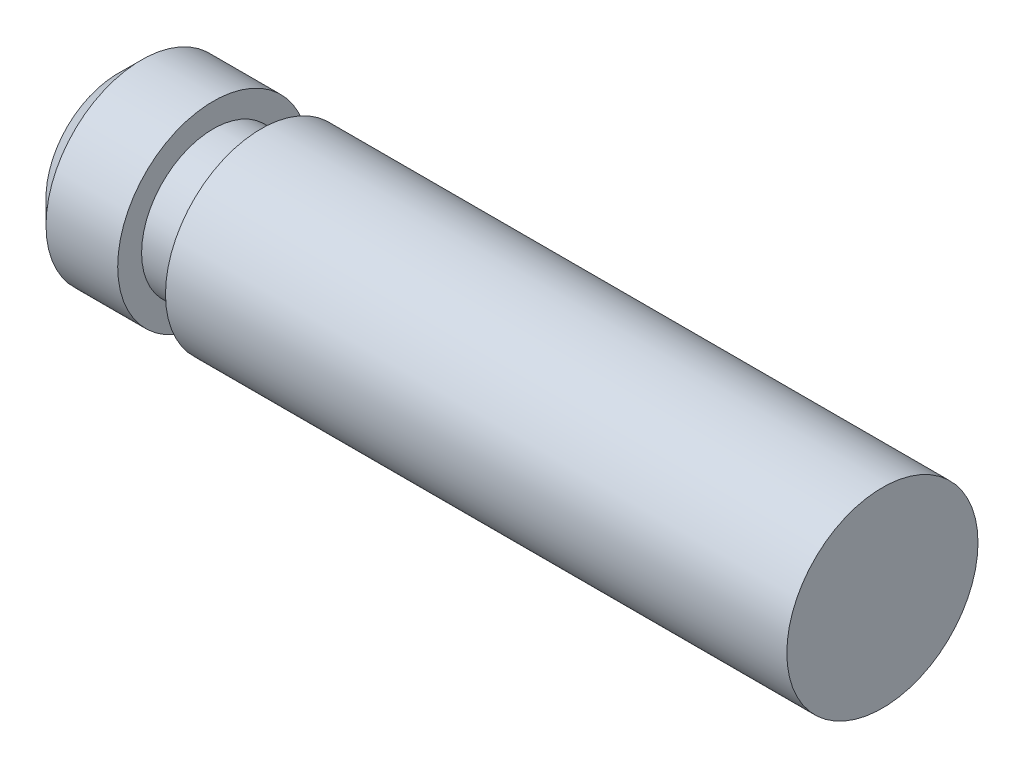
ISO-10303-21;
HEADER;
FILE_DESCRIPTION(('STEP AP214'),'2;1');
FILE_NAME('part.step','',(''),(''),'','','');
FILE_SCHEMA(('AUTOMOTIVE_DESIGN { 1 0 10303 214 1 1 1 1 }'));
ENDSEC;
DATA;
#1=APPLICATION_CONTEXT('core data for automotive mechanical design processes');
#2=APPLICATION_PROTOCOL_DEFINITION('international standard','automotive_design',2000,#1);
#3=PRODUCT_CONTEXT('',#1,'mechanical');
#4=PRODUCT('Part','Part','',(#3));
#5=PRODUCT_RELATED_PRODUCT_CATEGORY('part','',(#4));
#6=PRODUCT_DEFINITION_FORMATION('','',#4);
#7=PRODUCT_DEFINITION_CONTEXT('part definition',#1,'design');
#8=PRODUCT_DEFINITION('design','',#6,#7);
#9=PRODUCT_DEFINITION_SHAPE('','',#8);
#10=(LENGTH_UNIT() NAMED_UNIT(*) SI_UNIT(.MILLI.,.METRE.));
#11=(NAMED_UNIT(*) PLANE_ANGLE_UNIT() SI_UNIT($,.RADIAN.));
#12=(NAMED_UNIT(*) SI_UNIT($,.STERADIAN.) SOLID_ANGLE_UNIT());
#13=UNCERTAINTY_MEASURE_WITH_UNIT(LENGTH_MEASURE(1.E-05),#10,'distance_accuracy_value','');
#14=(GEOMETRIC_REPRESENTATION_CONTEXT(3) GLOBAL_UNCERTAINTY_ASSIGNED_CONTEXT((#13)) GLOBAL_UNIT_ASSIGNED_CONTEXT((#10,
#11,#12)) REPRESENTATION_CONTEXT('',''));
#15=CARTESIAN_POINT('',(0.,0.,0.));
#16=DIRECTION('',(0.,0.,1.));
#17=DIRECTION('',(1.,0.,0.));
#18=AXIS2_PLACEMENT_3D('',#15,#16,#17);
#19=CARTESIAN_POINT('',(0.,0.,0.));
#20=DIRECTION('',(1.,0.,0.));
#21=DIRECTION('',(0.,0.,-1.));
#22=AXIS2_PLACEMENT_3D('',#19,#20,#21);
#23=PLANE('',#22);
#24=CARTESIAN_POINT('',(0.,0.,0.));
#25=DIRECTION('',(1.,0.,0.));
#26=DIRECTION('',(0.,0.,-1.));
#27=AXIS2_PLACEMENT_3D('',#24,#25,#26);
#28=CIRCLE('',#27,1.5);
#29=CARTESIAN_POINT('',(0.,0.,-1.5));
#30=VERTEX_POINT('',#29);
#31=EDGE_CURVE('E37',#30,#30,#28,.F.);
#32=ORIENTED_EDGE('',*,*,#31,.T.);
#33=EDGE_LOOP('',(#32));
#34=FACE_BOUND('',#33,.T.);
#35=ADVANCED_FACE('F30',(#34),#23,.F.);
#36=CARTESIAN_POINT('',(-29.0102113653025,0.,0.));
#37=DIRECTION('',(-1.,0.,0.));
#38=DIRECTION('',(0.,0.,1.));
#39=AXIS2_PLACEMENT_3D('',#36,#37,#38);
#40=CYLINDRICAL_SURFACE('',#39,2.);
#41=CARTESIAN_POINT('',(0.5,0.,0.));
#42=DIRECTION('',(1.,0.,0.));
#43=DIRECTION('',(0.,0.,-1.));
#44=AXIS2_PLACEMENT_3D('',#41,#42,#43);
#45=CIRCLE('',#44,2.);
#46=CARTESIAN_POINT('',(0.5,0.,-2.));
#47=VERTEX_POINT('',#46);
#48=EDGE_CURVE('E10',#47,#47,#45,.T.);
#49=ORIENTED_EDGE('',*,*,#48,.T.);
#50=EDGE_LOOP('',(#49));
#51=FACE_BOUND('',#50,.T.);
#52=CARTESIAN_POINT('',(2.,0.,0.));
#53=DIRECTION('',(-1.,0.,0.));
#54=DIRECTION('',(0.,0.,1.));
#55=AXIS2_PLACEMENT_3D('',#52,#53,#54);
#56=CIRCLE('',#55,2.);
#57=CARTESIAN_POINT('',(2.,0.,2.));
#58=VERTEX_POINT('',#57);
#59=EDGE_CURVE('E41',#58,#58,#56,.T.);
#60=ORIENTED_EDGE('',*,*,#59,.T.);
#61=EDGE_LOOP('',(#60));
#62=FACE_BOUND('',#61,.T.);
#63=ADVANCED_FACE('F74',(#51,#62),#40,.T.);
#64=CARTESIAN_POINT('',(2.,2.,0.));
#65=DIRECTION('',(-1.,0.,0.));
#66=DIRECTION('',(0.,0.,1.));
#67=AXIS2_PLACEMENT_3D('',#64,#65,#66);
#68=PLANE('',#67);
#69=ORIENTED_EDGE('',*,*,#59,.F.);
#70=EDGE_LOOP('',(#69));
#71=FACE_BOUND('',#70,.T.);
#72=CARTESIAN_POINT('',(2.,0.,0.));
#73=DIRECTION('',(-1.,0.,0.));
#74=DIRECTION('',(0.,0.,1.));
#75=AXIS2_PLACEMENT_3D('',#72,#73,#74);
#76=CIRCLE('',#75,1.5);
#77=CARTESIAN_POINT('',(2.,0.,1.5));
#78=VERTEX_POINT('',#77);
#79=EDGE_CURVE('E45',#78,#78,#76,.T.);
#80=ORIENTED_EDGE('',*,*,#79,.T.);
#81=EDGE_LOOP('',(#80));
#82=FACE_BOUND('',#81,.T.);
#83=ADVANCED_FACE('F78',(#71,#82),#68,.F.);
#84=CARTESIAN_POINT('',(-29.0102113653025,0.,0.));
#85=DIRECTION('',(-1.,0.,0.));
#86=DIRECTION('',(0.,0.,1.));
#87=AXIS2_PLACEMENT_3D('',#84,#85,#86);
#88=CYLINDRICAL_SURFACE('',#87,1.5);
#89=ORIENTED_EDGE('',*,*,#79,.F.);
#90=EDGE_LOOP('',(#89));
#91=FACE_BOUND('',#90,.T.);
#92=CARTESIAN_POINT('',(3.,0.,0.));
#93=DIRECTION('',(-1.,0.,0.));
#94=DIRECTION('',(0.,0.,1.));
#95=AXIS2_PLACEMENT_3D('',#92,#93,#94);
#96=CIRCLE('',#95,1.5);
#97=CARTESIAN_POINT('',(3.,0.,1.5));
#98=VERTEX_POINT('',#97);
#99=EDGE_CURVE('E50',#98,#98,#96,.T.);
#100=ORIENTED_EDGE('',*,*,#99,.T.);
#101=EDGE_LOOP('',(#100));
#102=FACE_BOUND('',#101,.T.);
#103=ADVANCED_FACE('F83',(#91,#102),#88,.T.);
#104=CARTESIAN_POINT('',(3.,1.5,0.));
#105=DIRECTION('',(1.,0.,0.));
#106=DIRECTION('',(0.,0.,-1.));
#107=AXIS2_PLACEMENT_3D('',#104,#105,#106);
#108=PLANE('',#107);
#109=ORIENTED_EDGE('',*,*,#99,.F.);
#110=EDGE_LOOP('',(#109));
#111=FACE_BOUND('',#110,.T.);
#112=CARTESIAN_POINT('',(3.,0.,0.));
#113=DIRECTION('',(-1.,0.,0.));
#114=DIRECTION('',(0.,0.,1.));
#115=AXIS2_PLACEMENT_3D('',#112,#113,#114);
#116=CIRCLE('',#115,2.);
#117=CARTESIAN_POINT('',(3.,0.,2.));
#118=VERTEX_POINT('',#117);
#119=EDGE_CURVE('E53',#118,#118,#116,.T.);
#120=ORIENTED_EDGE('',*,*,#119,.T.);
#121=EDGE_LOOP('',(#120));
#122=FACE_BOUND('',#121,.T.);
#123=ADVANCED_FACE('F70',(#111,#122),#108,.F.);
#124=CARTESIAN_POINT('',(-29.0102113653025,0.,0.));
#125=DIRECTION('',(-1.,0.,0.));
#126=DIRECTION('',(0.,0.,1.));
#127=AXIS2_PLACEMENT_3D('',#124,#125,#126);
#128=CYLINDRICAL_SURFACE('',#127,2.);
#129=ORIENTED_EDGE('',*,*,#119,.F.);
#130=EDGE_LOOP('',(#129));
#131=FACE_BOUND('',#130,.T.);
#132=CARTESIAN_POINT('',(16.,0.,0.));
#133=DIRECTION('',(-1.,0.,0.));
#134=DIRECTION('',(0.,0.,1.));
#135=AXIS2_PLACEMENT_3D('',#132,#133,#134);
#136=CIRCLE('',#135,2.);
#137=CARTESIAN_POINT('',(16.,0.,2.));
#138=VERTEX_POINT('',#137);
#139=EDGE_CURVE('E56',#138,#138,#136,.T.);
#140=ORIENTED_EDGE('',*,*,#139,.T.);
#141=EDGE_LOOP('',(#140));
#142=FACE_BOUND('',#141,.T.);
#143=ADVANCED_FACE('F60',(#131,#142),#128,.T.);
#144=CARTESIAN_POINT('',(16.,2.,0.));
#145=DIRECTION('',(-1.,0.,0.));
#146=DIRECTION('',(0.,0.,1.));
#147=AXIS2_PLACEMENT_3D('',#144,#145,#146);
#148=PLANE('',#147);
#149=ORIENTED_EDGE('',*,*,#139,.F.);
#150=EDGE_LOOP('',(#149));
#151=FACE_BOUND('',#150,.T.);
#152=ADVANCED_FACE('F62',(#151),#148,.F.);
#153=CARTESIAN_POINT('',(0.,0.,0.));
#154=DIRECTION('',(1.,0.,0.));
#155=DIRECTION('',(0.,0.,-1.));
#156=AXIS2_PLACEMENT_3D('',#153,#154,#155);
#157=CONICAL_SURFACE('',#156,1.5,0.785398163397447);
#158=ORIENTED_EDGE('',*,*,#48,.F.);
#159=EDGE_LOOP('',(#158));
#160=FACE_BOUND('',#159,.T.);
#161=ORIENTED_EDGE('',*,*,#31,.F.);
#162=EDGE_LOOP('',(#161));
#163=FACE_BOUND('',#162,.T.);
#164=ADVANCED_FACE('F32',(#160,#163),#157,.T.);
#165=CLOSED_SHELL('',(#35,#63,#83,#103,#123,#143,#152,#164));
#166=MANIFOLD_SOLID_BREP('B2',#165);
#167=ADVANCED_BREP_SHAPE_REPRESENTATION('',(#18,#166),#14);
#168=SHAPE_DEFINITION_REPRESENTATION(#9,#167);
ENDSEC;
END-ISO-10303-21;
